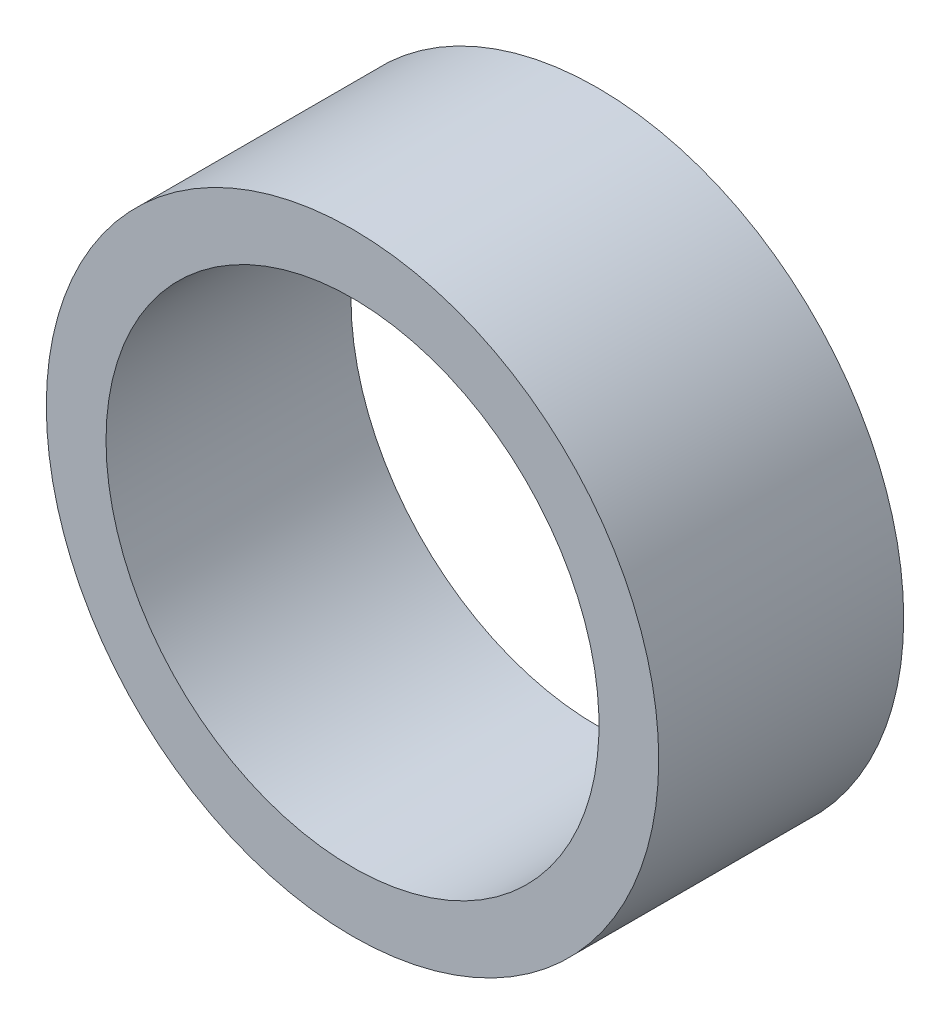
from build123d import *

# Parameters (mm, degrees)
LOGO3_BIB1_W = 1.548
LOGO3_BIB1_H = 6.35


with BuildPart() as part:
    # Logo3_bib1 → Revolve1 (revolve)
    with BuildSketch(Plane(origin=(0, 0, 0), x_dir=(-1, 0, 0), z_dir=(0, -1, 0))):
        with Locations((7.1635, -3.175)):
            Rectangle(LOGO3_BIB1_W, LOGO3_BIB1_H)
    revolve(axis=Axis((0, 0, -38.976362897), (0, 0, 1)))


solid = part.part
